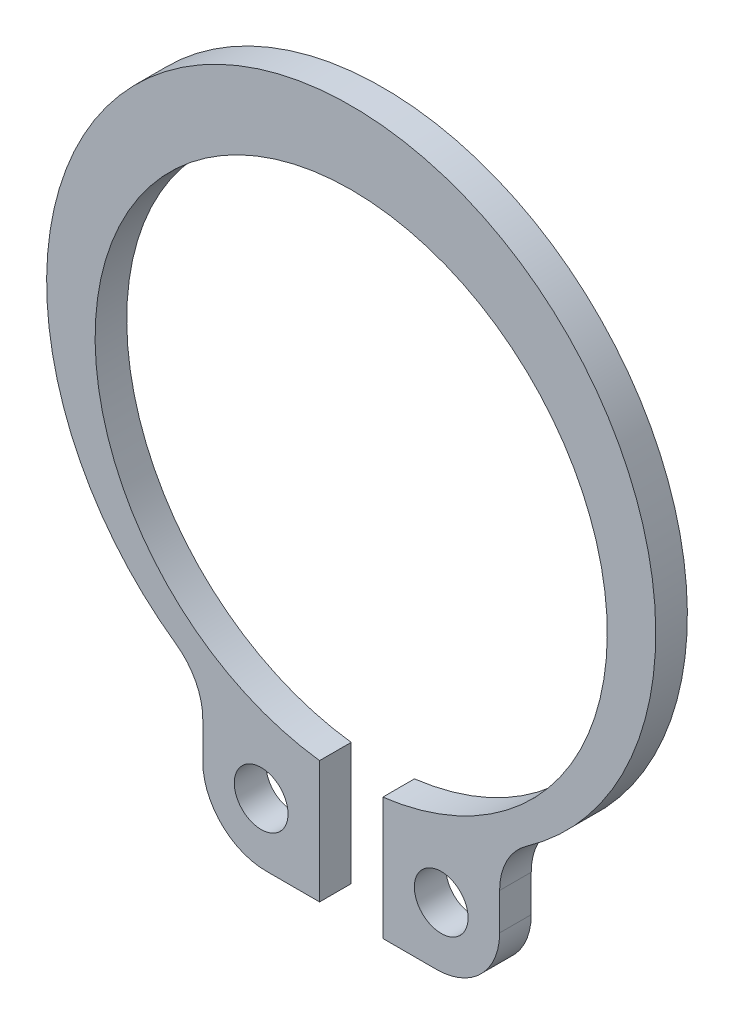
ISO-10303-21;
HEADER;
FILE_DESCRIPTION(('STEP AP214'),'2;1');
FILE_NAME('part.step','',(''),(''),'','','');
FILE_SCHEMA(('AUTOMOTIVE_DESIGN { 1 0 10303 214 1 1 1 1 }'));
ENDSEC;
DATA;
#1=APPLICATION_CONTEXT('core data for automotive mechanical design processes');
#2=APPLICATION_PROTOCOL_DEFINITION('international standard','automotive_design',2000,#1);
#3=PRODUCT_CONTEXT('',#1,'mechanical');
#4=PRODUCT('Part','Part','',(#3));
#5=PRODUCT_RELATED_PRODUCT_CATEGORY('part','',(#4));
#6=PRODUCT_DEFINITION_FORMATION('','',#4);
#7=PRODUCT_DEFINITION_CONTEXT('part definition',#1,'design');
#8=PRODUCT_DEFINITION('design','',#6,#7);
#9=PRODUCT_DEFINITION_SHAPE('','',#8);
#10=(LENGTH_UNIT() NAMED_UNIT(*) SI_UNIT(.MILLI.,.METRE.));
#11=(NAMED_UNIT(*) PLANE_ANGLE_UNIT() SI_UNIT($,.RADIAN.));
#12=(NAMED_UNIT(*) SI_UNIT($,.STERADIAN.) SOLID_ANGLE_UNIT());
#13=UNCERTAINTY_MEASURE_WITH_UNIT(LENGTH_MEASURE(1.E-05),#10,'distance_accuracy_value','');
#14=(GEOMETRIC_REPRESENTATION_CONTEXT(3) GLOBAL_UNCERTAINTY_ASSIGNED_CONTEXT((#13)) GLOBAL_UNIT_ASSIGNED_CONTEXT((#10,
#11,#12)) REPRESENTATION_CONTEXT('',''));
#15=CARTESIAN_POINT('',(0.,0.,0.));
#16=DIRECTION('',(0.,0.,1.));
#17=DIRECTION('',(1.,0.,0.));
#18=AXIS2_PLACEMENT_3D('',#15,#16,#17);
#19=CARTESIAN_POINT('',(0.,-1.3492906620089,0.));
#20=DIRECTION('',(0.,0.,1.));
#21=DIRECTION('',(1.,0.,0.));
#22=AXIS2_PLACEMENT_3D('',#19,#20,#21);
#23=PLANE('',#22);
#24=CARTESIAN_POINT('',(2.84745331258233,-10.,0.));
#25=DIRECTION('',(0.,0.,1.));
#26=DIRECTION('',(1.,0.,0.));
#27=AXIS2_PLACEMENT_3D('',#24,#25,#26);
#28=CIRCLE('',#27,0.85);
#29=CARTESIAN_POINT('',(3.69745331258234,-10.,0.));
#30=VERTEX_POINT('',#29);
#31=EDGE_CURVE('E174',#30,#30,#28,.T.);
#32=ORIENTED_EDGE('',*,*,#31,.T.);
#33=EDGE_LOOP('',(#32));
#34=FACE_BOUND('',#33,.T.);
#35=CARTESIAN_POINT('',(-2.84745331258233,-10.,0.));
#36=DIRECTION('',(0.,0.,1.));
#37=DIRECTION('',(1.,0.,0.));
#38=AXIS2_PLACEMENT_3D('',#35,#36,#37);
#39=CIRCLE('',#38,0.85);
#40=CARTESIAN_POINT('',(-1.99745331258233,-10.,0.));
#41=VERTEX_POINT('',#40);
#42=EDGE_CURVE('E177',#41,#41,#39,.T.);
#43=ORIENTED_EDGE('',*,*,#42,.T.);
#44=EDGE_LOOP('',(#43));
#45=FACE_BOUND('',#44,.T.);
#46=CARTESIAN_POINT('',(6.69490662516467,-8.74714801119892,0.));
#47=DIRECTION('',(0.,0.,1.));
#48=DIRECTION('',(1.,0.,0.));
#49=AXIS2_PLACEMENT_3D('',#46,#47,#48);
#50=CIRCLE('',#49,2.);
#51=CARTESIAN_POINT('',(5.54391981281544,-7.11153517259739,0.));
#52=VERTEX_POINT('',#51);
#53=CARTESIAN_POINT('',(4.69490662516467,-8.74714801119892,0.));
#54=VERTEX_POINT('',#53);
#55=EDGE_CURVE('E20',#52,#54,#50,.T.);
#56=ORIENTED_EDGE('',*,*,#55,.T.);
#57=DIRECTION('',(0.,1.,0.));
#58=VECTOR('',#57,1.);
#59=CARTESIAN_POINT('',(4.69490662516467,-8.74714801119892,0.));
#60=LINE('',#59,#58);
#61=CARTESIAN_POINT('',(4.69490662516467,-9.91,0.));
#62=VERTEX_POINT('',#61);
#63=EDGE_CURVE('E121',#62,#54,#60,.T.);
#64=ORIENTED_EDGE('',*,*,#63,.F.);
#65=CARTESIAN_POINT('',(2.69490662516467,-9.91,0.));
#66=DIRECTION('',(0.,0.,1.));
#67=DIRECTION('',(1.,0.,0.));
#68=AXIS2_PLACEMENT_3D('',#65,#66,#67);
#69=CIRCLE('',#68,2.);
#70=CARTESIAN_POINT('',(2.69490662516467,-11.91,0.));
#71=VERTEX_POINT('',#70);
#72=EDGE_CURVE('E180',#71,#62,#69,.T.);
#73=ORIENTED_EDGE('',*,*,#72,.F.);
#74=DIRECTION('',(1.,0.,0.));
#75=VECTOR('',#74,1.);
#76=CARTESIAN_POINT('',(2.69490662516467,-11.91,0.));
#77=LINE('',#76,#75);
#78=CARTESIAN_POINT('',(0.999999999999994,-11.91,0.));
#79=VERTEX_POINT('',#78);
#80=EDGE_CURVE('E123',#79,#71,#77,.T.);
#81=ORIENTED_EDGE('',*,*,#80,.F.);
#82=DIRECTION('',(0.,1.,0.));
#83=VECTOR('',#82,1.);
#84=CARTESIAN_POINT('',(0.999999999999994,-11.91,0.));
#85=LINE('',#84,#83);
#86=CARTESIAN_POINT('',(0.999999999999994,-8.03803458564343,0.));
#87=VERTEX_POINT('',#86);
#88=EDGE_CURVE('E129',#87,#79,#85,.F.);
#89=ORIENTED_EDGE('',*,*,#88,.F.);
#90=CARTESIAN_POINT('',(0.,0.,0.));
#91=DIRECTION('',(0.,0.,1.));
#92=DIRECTION('',(1.,0.,0.));
#93=AXIS2_PLACEMENT_3D('',#90,#91,#92);
#94=CIRCLE('',#93,8.1);
#95=CARTESIAN_POINT('',(-1.,-8.03803458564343,0.));
#96=VERTEX_POINT('',#95);
#97=EDGE_CURVE('E182',#87,#96,#94,.T.);
#98=ORIENTED_EDGE('',*,*,#97,.T.);
#99=DIRECTION('',(0.,1.,0.));
#100=VECTOR('',#99,1.);
#101=CARTESIAN_POINT('',(-1.,-8.03803458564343,0.));
#102=LINE('',#101,#100);
#103=CARTESIAN_POINT('',(-1.,-11.91,0.));
#104=VERTEX_POINT('',#103);
#105=EDGE_CURVE('E135',#104,#96,#102,.T.);
#106=ORIENTED_EDGE('',*,*,#105,.F.);
#107=DIRECTION('',(1.,0.,0.));
#108=VECTOR('',#107,1.);
#109=CARTESIAN_POINT('',(-1.00000000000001,-11.91,0.));
#110=LINE('',#109,#108);
#111=CARTESIAN_POINT('',(-2.69490662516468,-11.91,0.));
#112=VERTEX_POINT('',#111);
#113=EDGE_CURVE('E142',#112,#104,#110,.T.);
#114=ORIENTED_EDGE('',*,*,#113,.F.);
#115=CARTESIAN_POINT('',(-2.69490662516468,-9.91,0.));
#116=DIRECTION('',(0.,0.,1.));
#117=DIRECTION('',(1.,0.,0.));
#118=AXIS2_PLACEMENT_3D('',#115,#116,#117);
#119=CIRCLE('',#118,2.);
#120=CARTESIAN_POINT('',(-4.69490662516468,-9.91,0.));
#121=VERTEX_POINT('',#120);
#122=EDGE_CURVE('E184',#121,#112,#119,.T.);
#123=ORIENTED_EDGE('',*,*,#122,.F.);
#124=DIRECTION('',(0.,1.,0.));
#125=VECTOR('',#124,1.);
#126=CARTESIAN_POINT('',(-4.69490662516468,-9.91,0.));
#127=LINE('',#126,#125);
#128=CARTESIAN_POINT('',(-4.69490662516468,-8.74714801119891,0.));
#129=VERTEX_POINT('',#128);
#130=EDGE_CURVE('E148',#129,#121,#127,.F.);
#131=ORIENTED_EDGE('',*,*,#130,.F.);
#132=CARTESIAN_POINT('',(-6.69490662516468,-8.74714801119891,0.));
#133=DIRECTION('',(0.,0.,1.));
#134=DIRECTION('',(1.,0.,0.));
#135=AXIS2_PLACEMENT_3D('',#132,#133,#134);
#136=CIRCLE('',#135,2.);
#137=CARTESIAN_POINT('',(-5.54391981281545,-7.11153517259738,0.));
#138=VERTEX_POINT('',#137);
#139=EDGE_CURVE('E101',#129,#138,#136,.T.);
#140=ORIENTED_EDGE('',*,*,#139,.T.);
#141=CARTESIAN_POINT('',(0.,0.766666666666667,0.));
#142=DIRECTION('',(0.,0.,1.));
#143=DIRECTION('',(1.,0.,0.));
#144=AXIS2_PLACEMENT_3D('',#141,#142,#143);
#145=CIRCLE('',#144,9.63333333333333);
#146=EDGE_CURVE('E96',#52,#138,#145,.T.);
#147=ORIENTED_EDGE('',*,*,#146,.F.);
#148=EDGE_LOOP('',(#56,#64,#73,#81,#89,#98,#106,#114,#123,#131,#140,#147));
#149=FACE_BOUND('',#148,.T.);
#150=ADVANCED_FACE('F16',(#34,#45,#149),#23,.F.);
#151=CARTESIAN_POINT('',(6.69490662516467,-8.74714801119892,0.));
#152=DIRECTION('',(0.,0.,1.));
#153=DIRECTION('',(1.,0.,0.));
#154=AXIS2_PLACEMENT_3D('',#151,#152,#153);
#155=CYLINDRICAL_SURFACE('',#154,2.);
#156=DIRECTION('',(0.,0.,-1.));
#157=VECTOR('',#156,1.);
#158=CARTESIAN_POINT('',(4.69490662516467,-8.74714801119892,0.));
#159=LINE('',#158,#157);
#160=CARTESIAN_POINT('',(4.69490662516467,-8.74714801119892,1.));
#161=VERTEX_POINT('',#160);
#162=EDGE_CURVE('E111',#54,#161,#159,.F.);
#163=ORIENTED_EDGE('',*,*,#162,.F.);
#164=ORIENTED_EDGE('',*,*,#55,.F.);
#165=DIRECTION('',(0.,0.,1.));
#166=VECTOR('',#165,1.);
#167=CARTESIAN_POINT('',(5.54391981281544,-7.11153517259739,0.));
#168=LINE('',#167,#166);
#169=CARTESIAN_POINT('',(5.54391981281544,-7.11153517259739,1.));
#170=VERTEX_POINT('',#169);
#171=EDGE_CURVE('E106',#170,#52,#168,.F.);
#172=ORIENTED_EDGE('',*,*,#171,.F.);
#173=CARTESIAN_POINT('',(6.69490662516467,-8.74714801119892,1.));
#174=DIRECTION('',(0.,0.,1.));
#175=DIRECTION('',(1.,0.,0.));
#176=AXIS2_PLACEMENT_3D('',#173,#174,#175);
#177=CIRCLE('',#176,2.);
#178=EDGE_CURVE('E172',#161,#170,#177,.F.);
#179=ORIENTED_EDGE('',*,*,#178,.F.);
#180=EDGE_LOOP('',(#163,#164,#172,#179));
#181=FACE_BOUND('',#180,.T.);
#182=ADVANCED_FACE('F108',(#181),#155,.F.);
#183=CARTESIAN_POINT('',(0.,0.766666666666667,0.));
#184=DIRECTION('',(0.,0.,1.));
#185=DIRECTION('',(1.,0.,0.));
#186=AXIS2_PLACEMENT_3D('',#183,#184,#185);
#187=CYLINDRICAL_SURFACE('',#186,9.63333333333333);
#188=DIRECTION('',(0.,0.,1.));
#189=VECTOR('',#188,1.);
#190=CARTESIAN_POINT('',(-5.54391981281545,-7.11153517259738,0.));
#191=LINE('',#190,#189);
#192=CARTESIAN_POINT('',(-5.54391981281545,-7.11153517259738,1.));
#193=VERTEX_POINT('',#192);
#194=EDGE_CURVE('E119',#138,#193,#191,.T.);
#195=ORIENTED_EDGE('',*,*,#194,.T.);
#196=CARTESIAN_POINT('',(0.,0.766666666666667,1.));
#197=DIRECTION('',(0.,0.,1.));
#198=DIRECTION('',(1.,0.,0.));
#199=AXIS2_PLACEMENT_3D('',#196,#197,#198);
#200=CIRCLE('',#199,9.63333333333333);
#201=EDGE_CURVE('E114',#170,#193,#200,.T.);
#202=ORIENTED_EDGE('',*,*,#201,.F.);
#203=ORIENTED_EDGE('',*,*,#171,.T.);
#204=ORIENTED_EDGE('',*,*,#146,.T.);
#205=EDGE_LOOP('',(#195,#202,#203,#204));
#206=FACE_BOUND('',#205,.T.);
#207=ADVANCED_FACE('F113',(#206),#187,.T.);
#208=CARTESIAN_POINT('',(-6.69490662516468,-8.74714801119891,0.));
#209=DIRECTION('',(0.,0.,1.));
#210=DIRECTION('',(1.,0.,0.));
#211=AXIS2_PLACEMENT_3D('',#208,#209,#210);
#212=CYLINDRICAL_SURFACE('',#211,2.);
#213=ORIENTED_EDGE('',*,*,#194,.F.);
#214=ORIENTED_EDGE('',*,*,#139,.F.);
#215=DIRECTION('',(0.,0.,1.));
#216=VECTOR('',#215,1.);
#217=CARTESIAN_POINT('',(-4.69490662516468,-8.74714801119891,0.));
#218=LINE('',#217,#216);
#219=CARTESIAN_POINT('',(-4.69490662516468,-8.74714801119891,1.));
#220=VERTEX_POINT('',#219);
#221=EDGE_CURVE('E150',#220,#129,#218,.F.);
#222=ORIENTED_EDGE('',*,*,#221,.F.);
#223=CARTESIAN_POINT('',(-6.69490662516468,-8.74714801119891,1.));
#224=DIRECTION('',(0.,0.,1.));
#225=DIRECTION('',(1.,0.,0.));
#226=AXIS2_PLACEMENT_3D('',#223,#224,#225);
#227=CIRCLE('',#226,2.);
#228=EDGE_CURVE('E168',#193,#220,#227,.F.);
#229=ORIENTED_EDGE('',*,*,#228,.F.);
#230=EDGE_LOOP('',(#213,#214,#222,#229));
#231=FACE_BOUND('',#230,.T.);
#232=ADVANCED_FACE('F263',(#231),#212,.F.);
#233=CARTESIAN_POINT('',(-4.69490662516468,-9.91,0.));
#234=DIRECTION('',(-1.,0.,0.));
#235=DIRECTION('',(0.,0.,1.));
#236=AXIS2_PLACEMENT_3D('',#233,#234,#235);
#237=PLANE('',#236);
#238=ORIENTED_EDGE('',*,*,#130,.T.);
#239=DIRECTION('',(0.,0.,1.));
#240=VECTOR('',#239,1.);
#241=CARTESIAN_POINT('',(-4.69490662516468,-9.91,0.));
#242=LINE('',#241,#240);
#243=CARTESIAN_POINT('',(-4.69490662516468,-9.91,1.));
#244=VERTEX_POINT('',#243);
#245=EDGE_CURVE('E149',#244,#121,#242,.F.);
#246=ORIENTED_EDGE('',*,*,#245,.F.);
#247=DIRECTION('',(0.,1.,0.));
#248=VECTOR('',#247,1.);
#249=CARTESIAN_POINT('',(-4.69490662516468,-1.3492906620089,1.));
#250=LINE('',#249,#248);
#251=EDGE_CURVE('E167',#220,#244,#250,.F.);
#252=ORIENTED_EDGE('',*,*,#251,.F.);
#253=ORIENTED_EDGE('',*,*,#221,.T.);
#254=EDGE_LOOP('',(#238,#246,#252,#253));
#255=FACE_BOUND('',#254,.T.);
#256=ADVANCED_FACE('F261',(#255),#237,.T.);
#257=CARTESIAN_POINT('',(-2.69490662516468,-9.91,0.));
#258=DIRECTION('',(0.,0.,1.));
#259=DIRECTION('',(1.,0.,0.));
#260=AXIS2_PLACEMENT_3D('',#257,#258,#259);
#261=CYLINDRICAL_SURFACE('',#260,2.);
#262=ORIENTED_EDGE('',*,*,#122,.T.);
#263=DIRECTION('',(0.,0.,-1.));
#264=VECTOR('',#263,1.);
#265=CARTESIAN_POINT('',(-2.69490662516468,-11.91,0.));
#266=LINE('',#265,#264);
#267=CARTESIAN_POINT('',(-2.69490662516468,-11.91,1.));
#268=VERTEX_POINT('',#267);
#269=EDGE_CURVE('E145',#268,#112,#266,.T.);
#270=ORIENTED_EDGE('',*,*,#269,.F.);
#271=CARTESIAN_POINT('',(-2.69490662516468,-9.91,1.));
#272=DIRECTION('',(0.,0.,1.));
#273=DIRECTION('',(1.,0.,0.));
#274=AXIS2_PLACEMENT_3D('',#271,#272,#273);
#275=CIRCLE('',#274,2.);
#276=EDGE_CURVE('E163',#244,#268,#275,.T.);
#277=ORIENTED_EDGE('',*,*,#276,.F.);
#278=ORIENTED_EDGE('',*,*,#245,.T.);
#279=EDGE_LOOP('',(#262,#270,#277,#278));
#280=FACE_BOUND('',#279,.T.);
#281=ADVANCED_FACE('F260',(#280),#261,.T.);
#282=CARTESIAN_POINT('',(-1.00000000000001,-11.91,0.));
#283=DIRECTION('',(0.,-1.,0.));
#284=DIRECTION('',(0.,0.,-1.));
#285=AXIS2_PLACEMENT_3D('',#282,#283,#284);
#286=PLANE('',#285);
#287=ORIENTED_EDGE('',*,*,#113,.T.);
#288=DIRECTION('',(0.,0.,-1.));
#289=VECTOR('',#288,1.);
#290=CARTESIAN_POINT('',(-1.,-11.91,0.));
#291=LINE('',#290,#289);
#292=CARTESIAN_POINT('',(-1.00000000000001,-11.91,1.));
#293=VERTEX_POINT('',#292);
#294=EDGE_CURVE('E139',#293,#104,#291,.T.);
#295=ORIENTED_EDGE('',*,*,#294,.F.);
#296=DIRECTION('',(1.,0.,0.));
#297=VECTOR('',#296,1.);
#298=CARTESIAN_POINT('',(0.,-11.91,1.));
#299=LINE('',#298,#297);
#300=EDGE_CURVE('E166',#268,#293,#299,.T.);
#301=ORIENTED_EDGE('',*,*,#300,.F.);
#302=ORIENTED_EDGE('',*,*,#269,.T.);
#303=EDGE_LOOP('',(#287,#295,#301,#302));
#304=FACE_BOUND('',#303,.T.);
#305=ADVANCED_FACE('F250',(#304),#286,.T.);
#306=CARTESIAN_POINT('',(-1.,-8.03803458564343,0.));
#307=DIRECTION('',(1.,0.,0.));
#308=DIRECTION('',(0.,0.,-1.));
#309=AXIS2_PLACEMENT_3D('',#306,#307,#308);
#310=PLANE('',#309);
#311=ORIENTED_EDGE('',*,*,#105,.T.);
#312=DIRECTION('',(0.,0.,1.));
#313=VECTOR('',#312,1.);
#314=CARTESIAN_POINT('',(-1.,-8.03803458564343,0.));
#315=LINE('',#314,#313);
#316=CARTESIAN_POINT('',(-1.,-8.03803458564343,1.));
#317=VERTEX_POINT('',#316);
#318=EDGE_CURVE('E138',#96,#317,#315,.T.);
#319=ORIENTED_EDGE('',*,*,#318,.T.);
#320=DIRECTION('',(0.,1.,0.));
#321=VECTOR('',#320,1.);
#322=CARTESIAN_POINT('',(-1.00000000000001,-1.3492906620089,1.));
#323=LINE('',#322,#321);
#324=EDGE_CURVE('E162',#293,#317,#323,.T.);
#325=ORIENTED_EDGE('',*,*,#324,.F.);
#326=ORIENTED_EDGE('',*,*,#294,.T.);
#327=EDGE_LOOP('',(#311,#319,#325,#326));
#328=FACE_BOUND('',#327,.T.);
#329=ADVANCED_FACE('F256',(#328),#310,.T.);
#330=CARTESIAN_POINT('',(0.,0.,0.));
#331=DIRECTION('',(0.,0.,1.));
#332=DIRECTION('',(1.,0.,0.));
#333=AXIS2_PLACEMENT_3D('',#330,#331,#332);
#334=CYLINDRICAL_SURFACE('',#333,8.1);
#335=ORIENTED_EDGE('',*,*,#97,.F.);
#336=DIRECTION('',(0.,0.,1.));
#337=VECTOR('',#336,1.);
#338=CARTESIAN_POINT('',(0.999999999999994,-8.03803458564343,0.));
#339=LINE('',#338,#337);
#340=CARTESIAN_POINT('',(0.999999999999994,-8.03803458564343,1.));
#341=VERTEX_POINT('',#340);
#342=EDGE_CURVE('E132',#341,#87,#339,.F.);
#343=ORIENTED_EDGE('',*,*,#342,.F.);
#344=CARTESIAN_POINT('',(0.,0.,1.));
#345=DIRECTION('',(0.,0.,1.));
#346=DIRECTION('',(1.,0.,0.));
#347=AXIS2_PLACEMENT_3D('',#344,#345,#346);
#348=CIRCLE('',#347,8.1);
#349=EDGE_CURVE('E159',#317,#341,#348,.F.);
#350=ORIENTED_EDGE('',*,*,#349,.F.);
#351=ORIENTED_EDGE('',*,*,#318,.F.);
#352=EDGE_LOOP('',(#335,#343,#350,#351));
#353=FACE_BOUND('',#352,.T.);
#354=ADVANCED_FACE('F308',(#353),#334,.F.);
#355=CARTESIAN_POINT('',(0.999999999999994,-11.91,0.));
#356=DIRECTION('',(-1.,0.,0.));
#357=DIRECTION('',(0.,0.,1.));
#358=AXIS2_PLACEMENT_3D('',#355,#356,#357);
#359=PLANE('',#358);
#360=ORIENTED_EDGE('',*,*,#88,.T.);
#361=DIRECTION('',(0.,0.,-1.));
#362=VECTOR('',#361,1.);
#363=CARTESIAN_POINT('',(0.999999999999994,-11.91,0.));
#364=LINE('',#363,#362);
#365=CARTESIAN_POINT('',(0.999999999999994,-11.91,1.));
#366=VERTEX_POINT('',#365);
#367=EDGE_CURVE('E126',#366,#79,#364,.T.);
#368=ORIENTED_EDGE('',*,*,#367,.F.);
#369=DIRECTION('',(0.,1.,0.));
#370=VECTOR('',#369,1.);
#371=CARTESIAN_POINT('',(0.999999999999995,-1.3492906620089,1.));
#372=LINE('',#371,#370);
#373=EDGE_CURVE('E161',#341,#366,#372,.F.);
#374=ORIENTED_EDGE('',*,*,#373,.F.);
#375=ORIENTED_EDGE('',*,*,#342,.T.);
#376=EDGE_LOOP('',(#360,#368,#374,#375));
#377=FACE_BOUND('',#376,.T.);
#378=ADVANCED_FACE('F243',(#377),#359,.T.);
#379=CARTESIAN_POINT('',(2.69490662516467,-11.91,0.));
#380=DIRECTION('',(0.,-1.,0.));
#381=DIRECTION('',(0.,0.,-1.));
#382=AXIS2_PLACEMENT_3D('',#379,#380,#381);
#383=PLANE('',#382);
#384=ORIENTED_EDGE('',*,*,#80,.T.);
#385=DIRECTION('',(0.,0.,1.));
#386=VECTOR('',#385,1.);
#387=CARTESIAN_POINT('',(2.69490662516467,-11.91,0.));
#388=LINE('',#387,#386);
#389=CARTESIAN_POINT('',(2.69490662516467,-11.91,1.));
#390=VERTEX_POINT('',#389);
#391=EDGE_CURVE('E125',#390,#71,#388,.F.);
#392=ORIENTED_EDGE('',*,*,#391,.F.);
#393=DIRECTION('',(1.,0.,0.));
#394=VECTOR('',#393,1.);
#395=CARTESIAN_POINT('',(0.,-11.91,1.));
#396=LINE('',#395,#394);
#397=EDGE_CURVE('E158',#366,#390,#396,.T.);
#398=ORIENTED_EDGE('',*,*,#397,.F.);
#399=ORIENTED_EDGE('',*,*,#367,.T.);
#400=EDGE_LOOP('',(#384,#392,#398,#399));
#401=FACE_BOUND('',#400,.T.);
#402=ADVANCED_FACE('F238',(#401),#383,.T.);
#403=CARTESIAN_POINT('',(2.69490662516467,-9.91,0.));
#404=DIRECTION('',(0.,0.,1.));
#405=DIRECTION('',(1.,0.,0.));
#406=AXIS2_PLACEMENT_3D('',#403,#404,#405);
#407=CYLINDRICAL_SURFACE('',#406,2.);
#408=ORIENTED_EDGE('',*,*,#72,.T.);
#409=DIRECTION('',(0.,0.,-1.));
#410=VECTOR('',#409,1.);
#411=CARTESIAN_POINT('',(4.69490662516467,-9.91,0.));
#412=LINE('',#411,#410);
#413=CARTESIAN_POINT('',(4.69490662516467,-9.91,1.));
#414=VERTEX_POINT('',#413);
#415=EDGE_CURVE('E35',#414,#62,#412,.T.);
#416=ORIENTED_EDGE('',*,*,#415,.F.);
#417=CARTESIAN_POINT('',(2.69490662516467,-9.91,1.));
#418=DIRECTION('',(0.,0.,1.));
#419=DIRECTION('',(1.,0.,0.));
#420=AXIS2_PLACEMENT_3D('',#417,#418,#419);
#421=CIRCLE('',#420,2.);
#422=EDGE_CURVE('E155',#390,#414,#421,.T.);
#423=ORIENTED_EDGE('',*,*,#422,.F.);
#424=ORIENTED_EDGE('',*,*,#391,.T.);
#425=EDGE_LOOP('',(#408,#416,#423,#424));
#426=FACE_BOUND('',#425,.T.);
#427=ADVANCED_FACE('F235',(#426),#407,.T.);
#428=CARTESIAN_POINT('',(4.69490662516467,-8.74714801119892,0.));
#429=DIRECTION('',(1.,0.,0.));
#430=DIRECTION('',(0.,0.,-1.));
#431=AXIS2_PLACEMENT_3D('',#428,#429,#430);
#432=PLANE('',#431);
#433=ORIENTED_EDGE('',*,*,#63,.T.);
#434=ORIENTED_EDGE('',*,*,#162,.T.);
#435=DIRECTION('',(0.,1.,0.));
#436=VECTOR('',#435,1.);
#437=CARTESIAN_POINT('',(4.69490662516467,-1.3492906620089,1.));
#438=LINE('',#437,#436);
#439=EDGE_CURVE('E154',#414,#161,#438,.T.);
#440=ORIENTED_EDGE('',*,*,#439,.F.);
#441=ORIENTED_EDGE('',*,*,#415,.T.);
#442=EDGE_LOOP('',(#433,#434,#440,#441));
#443=FACE_BOUND('',#442,.T.);
#444=ADVANCED_FACE('F231',(#443),#432,.T.);
#445=CARTESIAN_POINT('',(-2.84745331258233,-10.,0.5));
#446=DIRECTION('',(0.,0.,1.));
#447=DIRECTION('',(1.,0.,0.));
#448=AXIS2_PLACEMENT_3D('',#445,#446,#447);
#449=CYLINDRICAL_SURFACE('',#448,0.85);
#450=CARTESIAN_POINT('',(-2.84745331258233,-10.,1.));
#451=DIRECTION('',(0.,0.,1.));
#452=DIRECTION('',(1.,0.,0.));
#453=AXIS2_PLACEMENT_3D('',#450,#451,#452);
#454=CIRCLE('',#453,0.85);
#455=CARTESIAN_POINT('',(-1.99745331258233,-10.,1.));
#456=VERTEX_POINT('',#455);
#457=EDGE_CURVE('E26',#456,#456,#454,.F.);
#458=ORIENTED_EDGE('',*,*,#457,.F.);
#459=EDGE_LOOP('',(#458));
#460=FACE_BOUND('',#459,.T.);
#461=ORIENTED_EDGE('',*,*,#42,.F.);
#462=EDGE_LOOP('',(#461));
#463=FACE_BOUND('',#462,.T.);
#464=ADVANCED_FACE('F277',(#460,#463),#449,.F.);
#465=CARTESIAN_POINT('',(2.84745331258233,-10.,0.5));
#466=DIRECTION('',(0.,0.,1.));
#467=DIRECTION('',(1.,0.,0.));
#468=AXIS2_PLACEMENT_3D('',#465,#466,#467);
#469=CYLINDRICAL_SURFACE('',#468,0.85);
#470=CARTESIAN_POINT('',(2.84745331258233,-10.,1.));
#471=DIRECTION('',(0.,0.,1.));
#472=DIRECTION('',(1.,0.,0.));
#473=AXIS2_PLACEMENT_3D('',#470,#471,#472);
#474=CIRCLE('',#473,0.85);
#475=CARTESIAN_POINT('',(3.69745331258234,-10.,1.));
#476=VERTEX_POINT('',#475);
#477=EDGE_CURVE('E10',#476,#476,#474,.F.);
#478=ORIENTED_EDGE('',*,*,#477,.F.);
#479=EDGE_LOOP('',(#478));
#480=FACE_BOUND('',#479,.T.);
#481=ORIENTED_EDGE('',*,*,#31,.F.);
#482=EDGE_LOOP('',(#481));
#483=FACE_BOUND('',#482,.T.);
#484=ADVANCED_FACE('F273',(#480,#483),#469,.F.);
#485=CARTESIAN_POINT('',(0.,-1.3492906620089,1.));
#486=DIRECTION('',(0.,0.,1.));
#487=DIRECTION('',(1.,0.,0.));
#488=AXIS2_PLACEMENT_3D('',#485,#486,#487);
#489=PLANE('',#488);
#490=ORIENTED_EDGE('',*,*,#477,.T.);
#491=EDGE_LOOP('',(#490));
#492=FACE_BOUND('',#491,.T.);
#493=ORIENTED_EDGE('',*,*,#457,.T.);
#494=EDGE_LOOP('',(#493));
#495=FACE_BOUND('',#494,.T.);
#496=ORIENTED_EDGE('',*,*,#422,.T.);
#497=ORIENTED_EDGE('',*,*,#439,.T.);
#498=ORIENTED_EDGE('',*,*,#178,.T.);
#499=ORIENTED_EDGE('',*,*,#201,.T.);
#500=ORIENTED_EDGE('',*,*,#228,.T.);
#501=ORIENTED_EDGE('',*,*,#251,.T.);
#502=ORIENTED_EDGE('',*,*,#276,.T.);
#503=ORIENTED_EDGE('',*,*,#300,.T.);
#504=ORIENTED_EDGE('',*,*,#324,.T.);
#505=ORIENTED_EDGE('',*,*,#349,.T.);
#506=ORIENTED_EDGE('',*,*,#373,.T.);
#507=ORIENTED_EDGE('',*,*,#397,.T.);
#508=EDGE_LOOP('',(#496,#497,#498,#499,#500,#501,#502,#503,#504,#505,#506,#507));
#509=FACE_BOUND('',#508,.T.);
#510=ADVANCED_FACE('F18',(#492,#495,#509),#489,.T.);
#511=CLOSED_SHELL('',(#150,#182,#207,#232,#256,#281,#305,#329,#354,#378,#402,#427,#444,#464,
#484,#510));
#512=MANIFOLD_SOLID_BREP('B1',#511);
#513=ADVANCED_BREP_SHAPE_REPRESENTATION('',(#18,#512),#14);
#514=SHAPE_DEFINITION_REPRESENTATION(#9,#513);
ENDSEC;
END-ISO-10303-21;
